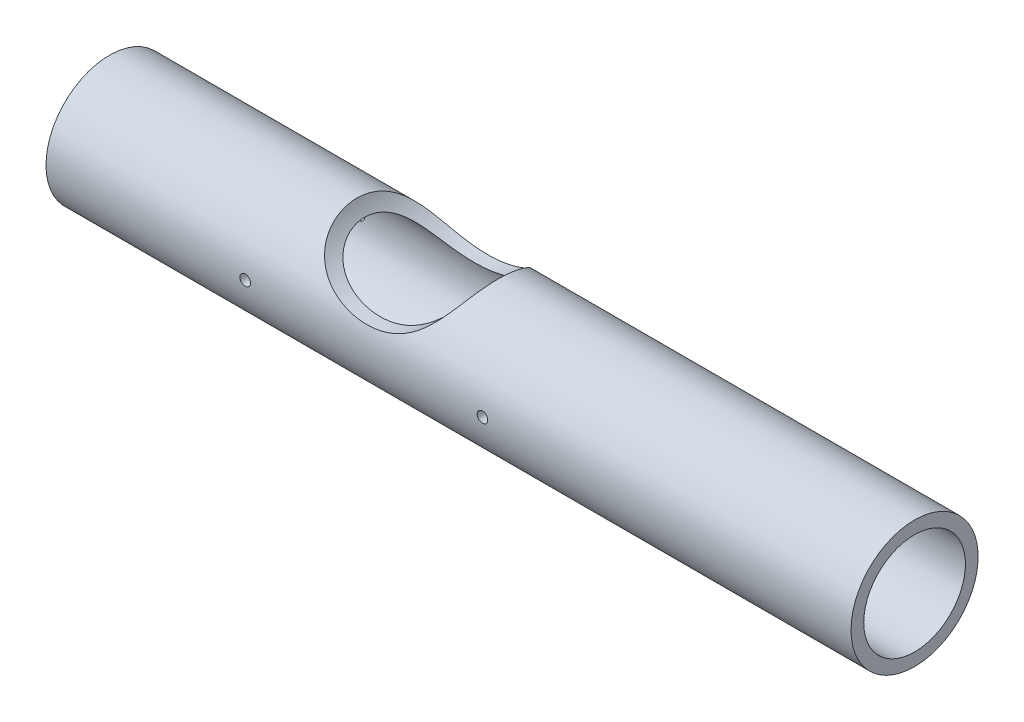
from build123d import *

# Parameters (mm, degrees)
ESQUISSE2_R             = 1.25
ENL_V_MAT_EXTRU_1_DEPTH = 17
ENL_V_MAT_EXTRU_2_DEPTH = 15


with BuildPart() as part:
    # Esquisse1 → Base-R_volution (revolve)
    with BuildSketch(Plane.XY, mode=Mode.PRIVATE) as base_r_volution_sk:
        Polygon((-11.817653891, 15), (73.182346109, 15), (178.182346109, 15), (178.182346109, 12), (-11.817653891, 12), align=None)
    revolve(base_r_volution_sk.sketch.rotate(Axis((-13.443670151, 0, 0), (1, 0, 0)), 90), axis=Axis((-13.443670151, 0, 0), (1, 0, 0)))

    # Esquisse2 → Enl_v. mat.-Extru.1 (cut, symmetric)
    with BuildSketch(Plane.XY):
        with Locations((35.182346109, 0)):
            Circle(ESQUISSE2_R)
        with Locations((91.182346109, 0)):
            Circle(ESQUISSE2_R)
    extrude(amount=ENL_V_MAT_EXTRU_1_DEPTH, both=True, mode=Mode.SUBTRACT)

    # Esquisse3 → Enl_v. mat.-Extru.2 (cut, symmetric)
    with BuildSketch(Plane.XY):
        with BuildLine():
            Line((46.182346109, 30.122624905), (80.182346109, 30.122624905))
            ThreePointArc((80.182346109, 30.122624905), (63.182346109, 4.568185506), (46.182346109, 30.122624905))
        make_face()
    extrude(amount=ENL_V_MAT_EXTRU_2_DEPTH, both=True, mode=Mode.SUBTRACT)


solid = part.part
